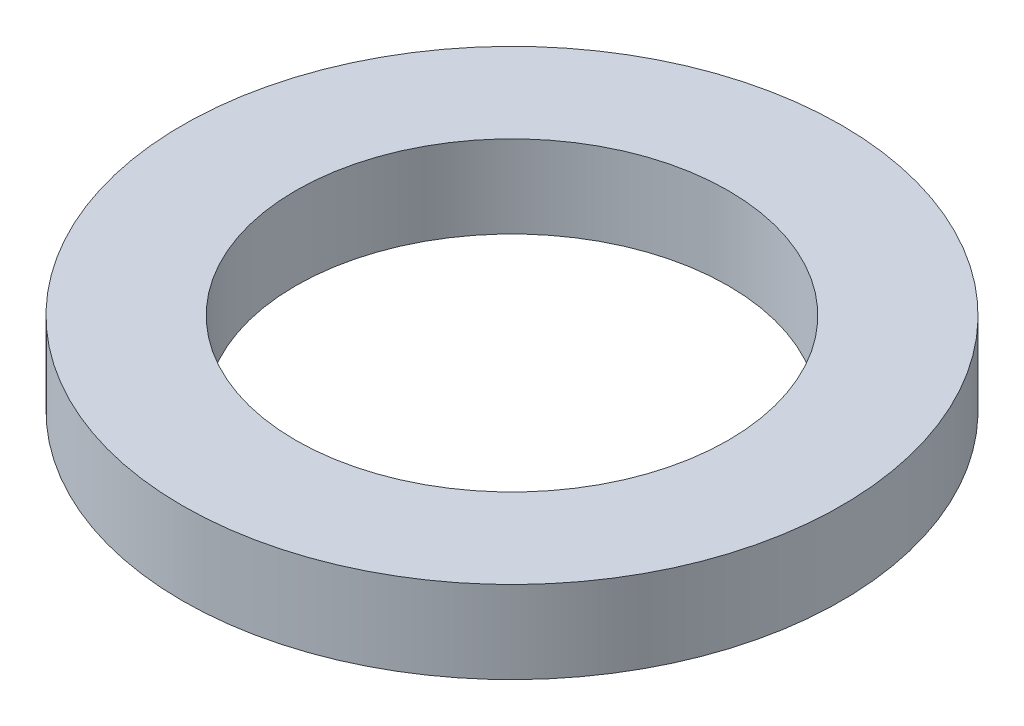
ISO-10303-21;
HEADER;
FILE_DESCRIPTION(('STEP AP214'),'2;1');
FILE_NAME('part.step','',(''),(''),'','','');
FILE_SCHEMA(('AUTOMOTIVE_DESIGN { 1 0 10303 214 1 1 1 1 }'));
ENDSEC;
DATA;
#1=APPLICATION_CONTEXT('core data for automotive mechanical design processes');
#2=APPLICATION_PROTOCOL_DEFINITION('international standard','automotive_design',2000,#1);
#3=PRODUCT_CONTEXT('',#1,'mechanical');
#4=PRODUCT('Part','Part','',(#3));
#5=PRODUCT_RELATED_PRODUCT_CATEGORY('part','',(#4));
#6=PRODUCT_DEFINITION_FORMATION('','',#4);
#7=PRODUCT_DEFINITION_CONTEXT('part definition',#1,'design');
#8=PRODUCT_DEFINITION('design','',#6,#7);
#9=PRODUCT_DEFINITION_SHAPE('','',#8);
#10=(LENGTH_UNIT() NAMED_UNIT(*) SI_UNIT(.MILLI.,.METRE.));
#11=(NAMED_UNIT(*) PLANE_ANGLE_UNIT() SI_UNIT($,.RADIAN.));
#12=(NAMED_UNIT(*) SI_UNIT($,.STERADIAN.) SOLID_ANGLE_UNIT());
#13=UNCERTAINTY_MEASURE_WITH_UNIT(LENGTH_MEASURE(1.E-05),#10,'distance_accuracy_value','');
#14=(GEOMETRIC_REPRESENTATION_CONTEXT(3) GLOBAL_UNCERTAINTY_ASSIGNED_CONTEXT((#13)) GLOBAL_UNIT_ASSIGNED_CONTEXT((#10,
#11,#12)) REPRESENTATION_CONTEXT('',''));
#15=CARTESIAN_POINT('',(0.,0.,0.));
#16=DIRECTION('',(0.,0.,1.));
#17=DIRECTION('',(1.,0.,0.));
#18=AXIS2_PLACEMENT_3D('',#15,#16,#17);
#19=CARTESIAN_POINT('',(0.,0.,0.));
#20=DIRECTION('',(0.,-1.,0.));
#21=DIRECTION('',(0.,0.,-1.));
#22=AXIS2_PLACEMENT_3D('',#19,#20,#21);
#23=CYLINDRICAL_SURFACE('',#22,5.25);
#24=CARTESIAN_POINT('',(0.,2.,0.));
#25=DIRECTION('',(0.,-1.,0.));
#26=DIRECTION('',(0.,0.,-1.));
#27=AXIS2_PLACEMENT_3D('',#24,#25,#26);
#28=CIRCLE('',#27,5.25);
#29=CARTESIAN_POINT('',(0.,2.,-5.25));
#30=VERTEX_POINT('',#29);
#31=EDGE_CURVE('E10',#30,#30,#28,.T.);
#32=ORIENTED_EDGE('',*,*,#31,.F.);
#33=EDGE_LOOP('',(#32));
#34=FACE_BOUND('',#33,.T.);
#35=CARTESIAN_POINT('',(0.,0.,0.));
#36=DIRECTION('',(0.,-1.,0.));
#37=DIRECTION('',(0.,0.,-1.));
#38=AXIS2_PLACEMENT_3D('',#35,#36,#37);
#39=CIRCLE('',#38,5.25);
#40=CARTESIAN_POINT('',(0.,0.,-5.25));
#41=VERTEX_POINT('',#40);
#42=EDGE_CURVE('E29',#41,#41,#39,.T.);
#43=ORIENTED_EDGE('',*,*,#42,.T.);
#44=EDGE_LOOP('',(#43));
#45=FACE_BOUND('',#44,.T.);
#46=ADVANCED_FACE('F15',(#34,#45),#23,.F.);
#47=CARTESIAN_POINT('',(8.,2.,0.));
#48=DIRECTION('',(0.,1.,0.));
#49=DIRECTION('',(0.,0.,1.));
#50=AXIS2_PLACEMENT_3D('',#47,#48,#49);
#51=PLANE('',#50);
#52=ORIENTED_EDGE('',*,*,#31,.T.);
#53=EDGE_LOOP('',(#52));
#54=FACE_BOUND('',#53,.T.);
#55=CARTESIAN_POINT('',(0.,2.,0.));
#56=DIRECTION('',(0.,-1.,0.));
#57=DIRECTION('',(0.,0.,-1.));
#58=AXIS2_PLACEMENT_3D('',#55,#56,#57);
#59=CIRCLE('',#58,8.);
#60=CARTESIAN_POINT('',(0.,2.,-8.));
#61=VERTEX_POINT('',#60);
#62=EDGE_CURVE('E21',#61,#61,#59,.T.);
#63=ORIENTED_EDGE('',*,*,#62,.F.);
#64=EDGE_LOOP('',(#63));
#65=FACE_BOUND('',#64,.T.);
#66=ADVANCED_FACE('F45',(#54,#65),#51,.T.);
#67=CARTESIAN_POINT('',(0.,0.,0.));
#68=DIRECTION('',(0.,-1.,0.));
#69=DIRECTION('',(0.,0.,-1.));
#70=AXIS2_PLACEMENT_3D('',#67,#68,#69);
#71=CYLINDRICAL_SURFACE('',#70,8.);
#72=ORIENTED_EDGE('',*,*,#62,.T.);
#73=EDGE_LOOP('',(#72));
#74=FACE_BOUND('',#73,.T.);
#75=CARTESIAN_POINT('',(0.,0.,0.));
#76=DIRECTION('',(0.,-1.,0.));
#77=DIRECTION('',(0.,0.,-1.));
#78=AXIS2_PLACEMENT_3D('',#75,#76,#77);
#79=CIRCLE('',#78,8.);
#80=CARTESIAN_POINT('',(0.,0.,-8.));
#81=VERTEX_POINT('',#80);
#82=EDGE_CURVE('E25',#81,#81,#79,.T.);
#83=ORIENTED_EDGE('',*,*,#82,.F.);
#84=EDGE_LOOP('',(#83));
#85=FACE_BOUND('',#84,.T.);
#86=ADVANCED_FACE('F38',(#74,#85),#71,.T.);
#87=CARTESIAN_POINT('',(5.25,0.,0.));
#88=DIRECTION('',(0.,-1.,0.));
#89=DIRECTION('',(0.,0.,-1.));
#90=AXIS2_PLACEMENT_3D('',#87,#88,#89);
#91=PLANE('',#90);
#92=ORIENTED_EDGE('',*,*,#82,.T.);
#93=EDGE_LOOP('',(#92));
#94=FACE_BOUND('',#93,.T.);
#95=ORIENTED_EDGE('',*,*,#42,.F.);
#96=EDGE_LOOP('',(#95));
#97=FACE_BOUND('',#96,.T.);
#98=ADVANCED_FACE('F36',(#94,#97),#91,.T.);
#99=CLOSED_SHELL('',(#46,#66,#86,#98));
#100=MANIFOLD_SOLID_BREP('B1',#99);
#101=ADVANCED_BREP_SHAPE_REPRESENTATION('',(#18,#100),#14);
#102=SHAPE_DEFINITION_REPRESENTATION(#9,#101);
ENDSEC;
END-ISO-10303-21;
